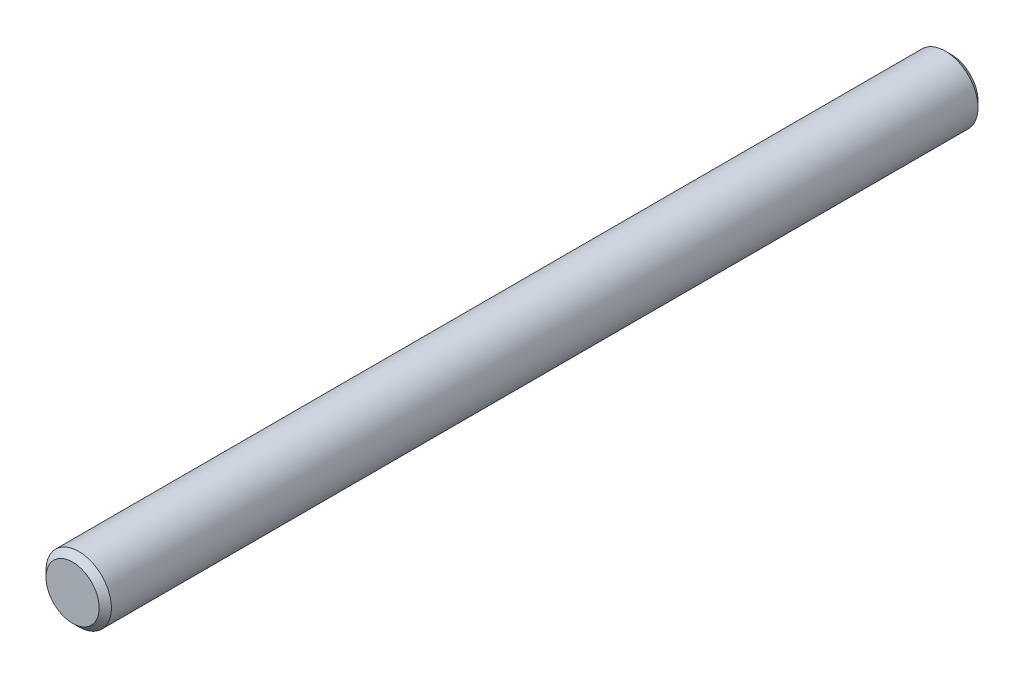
from build123d import *

# Parameters (mm, degrees)
ESQUISSE1_R     = 8
VOLUME_DEPTH    = 215
CHANFREIN1_SIZE = 1.5


with BuildPart() as part:
    # Esquisse1 → Volume (new body)
    with BuildSketch(Plane.XY):
        Circle(ESQUISSE1_R)
    extrude(amount=VOLUME_DEPTH)

    # Chanfrein1
    chanfrein1_edges = [part.edges().sort_by_distance(p)[0] for p in [
        (-8, 0, 0),
        (-8, 0, 215),
    ]]
    chamfer(chanfrein1_edges, length=CHANFREIN1_SIZE)


solid = part.part
